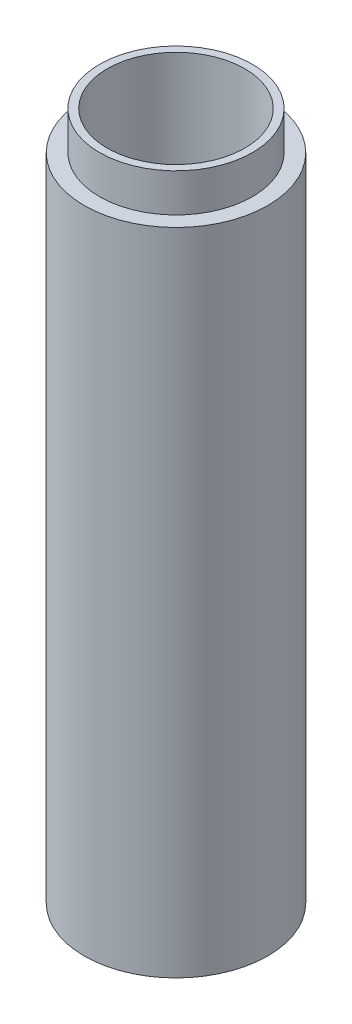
from build123d import *

# Parameters (mm, degrees)
SKETCH_1_R          = 12
SKETCH_1_R_2        = 9
EXTRUDE_1_DEPTH     = 45
SKETCH_2_R          = 12
SKETCH_2_R_2        = 10
CUT_EXTRUDE_1_DEPTH = 5


with BuildPart() as part:
    # Sketch 1 → Extrude 1 (new, symmetric)
    with BuildSketch(Plane(origin=(0, 0, 0), x_dir=(1, 0, 0), z_dir=(0, 1, 0))):
        with Locations(Location((0, 0, 0), (0, 0, 90))):
            Circle(SKETCH_1_R)
        with Locations(Location((0, 0, 0), (0, 0, 90))):
            Circle(SKETCH_1_R_2, mode=Mode.SUBTRACT)
    extrude(amount=EXTRUDE_1_DEPTH, both=True)

    # Sketch 2 → Cut-Extrude 1 (cut)
    with BuildSketch(Plane(origin=(0, 45, 0), x_dir=(1, 0, 0), z_dir=(0, 1, 0))):
        with Locations(Location((0, 0, 0), (0, 0, 90))):
            Circle(SKETCH_2_R)
        with Locations(Location((0, 0, 0), (0, 0, 270))):
            Circle(SKETCH_2_R_2, mode=Mode.SUBTRACT)
    extrude(amount=-CUT_EXTRUDE_1_DEPTH, mode=Mode.SUBTRACT)


solid = part.part
